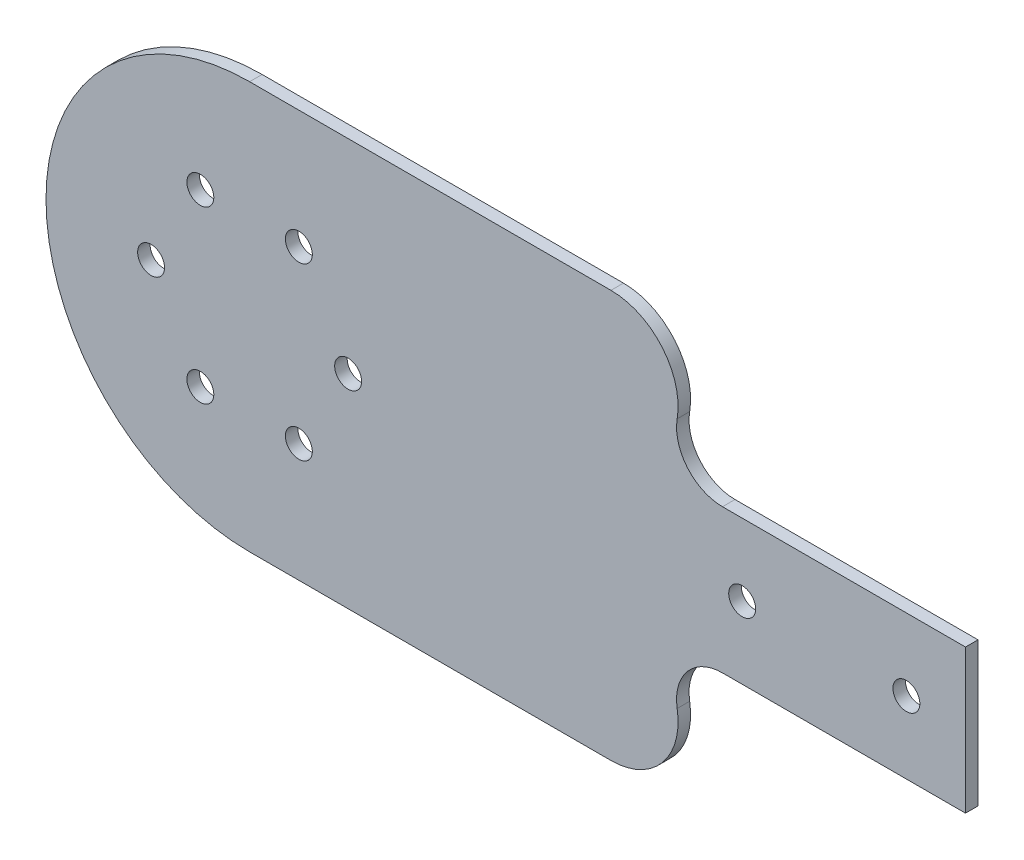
from build123d import *

# Parameters (mm, degrees)
BOSS_EXTRUDE1_DEPTH = 1.905
SKETCH2_R           = 2.05
CUT_EXTRUDE1_DEPTH  = 114.338559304


with BuildPart() as part:
    # Sketch1 → Boss-Extrude1 (new body)
    with BuildSketch(Plane(origin=(0, 0, 0), x_dir=(0, 1, 0), z_dir=(0, 0, 1))):
        with BuildLine():
            Line((-31, 0), (-31, -55.02))
            ThreePointArc((-31, -55.02), (-27.38533419, -62.819199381), (-19.097916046, -65.102184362))
            ThreePointArc((-19.097916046, -65.102184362), (-13.428005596, -66.664108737), (-10.955, -72))
            Line((-10.955, -72), (-10.955, -109))
            Line((-10.955, -109), (10.955, -109))
            Line((10.955, -109), (10.955, -72))
            ThreePointArc((10.955, -72), (13.428005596, -66.664108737), (19.097916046, -65.102184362))
            ThreePointArc((19.097916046, -65.102184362), (27.38533419, -62.819199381), (31, -55.02))
            Line((31, -55.02), (31, 0))
            ThreePointArc((31, 0), (0, 31), (-31, 0))
        make_face()
    extrude(amount=BOSS_EXTRUDE1_DEPTH)

    # Sketch2 → Cut-Extrude1 (cut, through all)
    with BuildSketch(Plane.XY.offset(1.905)):
        with Locations((-15, 0)):
            Circle(SKETCH2_R)
        with Locations((-7.5, 12.990381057)):
            Circle(SKETCH2_R)
        with Locations((7.5, 12.990381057)):
            Circle(SKETCH2_R)
        with Locations((15, 0)):
            Circle(SKETCH2_R)
        with Locations((7.5, -12.990381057)):
            Circle(SKETCH2_R)
        with Locations((-7.5, -12.990381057)):
            Circle(SKETCH2_R)
        with Locations((100, 0)):
            Circle(SKETCH2_R)
        with Locations((75, 0)):
            Circle(SKETCH2_R)
    extrude(amount=-CUT_EXTRUDE1_DEPTH, mode=Mode.SUBTRACT)


solid = part.part
